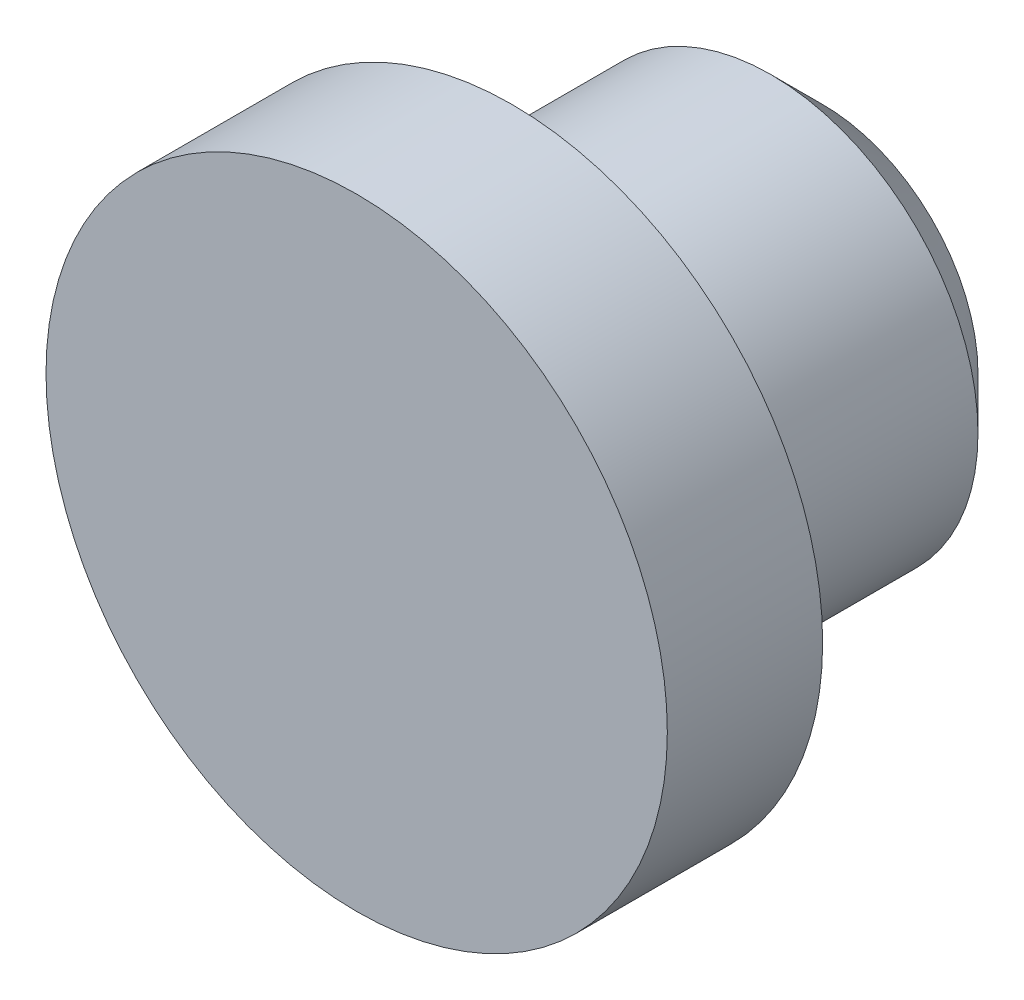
from build123d import *

# Parameters (mm, degrees)
ESQUISSE1_R        = 4
BOSS_EXTRU_1_DEPTH = 6
ESQUISSE2_R        = 6
BOSS_EXTRU_2_DEPTH = 3
CHANFREIN1_SIZE    = 1


with BuildPart() as part:
    # Esquisse1 → Boss.-Extru.1 (new body)
    with BuildSketch(Plane.XY):
        Circle(ESQUISSE1_R)
    extrude(amount=BOSS_EXTRU_1_DEPTH)

    # Esquisse2 → Boss.-Extru.2 (add)
    with BuildSketch(Plane.XY.offset(6)):
        Circle(ESQUISSE2_R)
    extrude(amount=BOSS_EXTRU_2_DEPTH)

    # Chanfrein1
    chanfrein1_edges = [part.edges().sort_by_distance(p)[0] for p in [
        (-4, 0, 0),
    ]]
    chamfer(chanfrein1_edges, length=CHANFREIN1_SIZE)


solid = part.part
